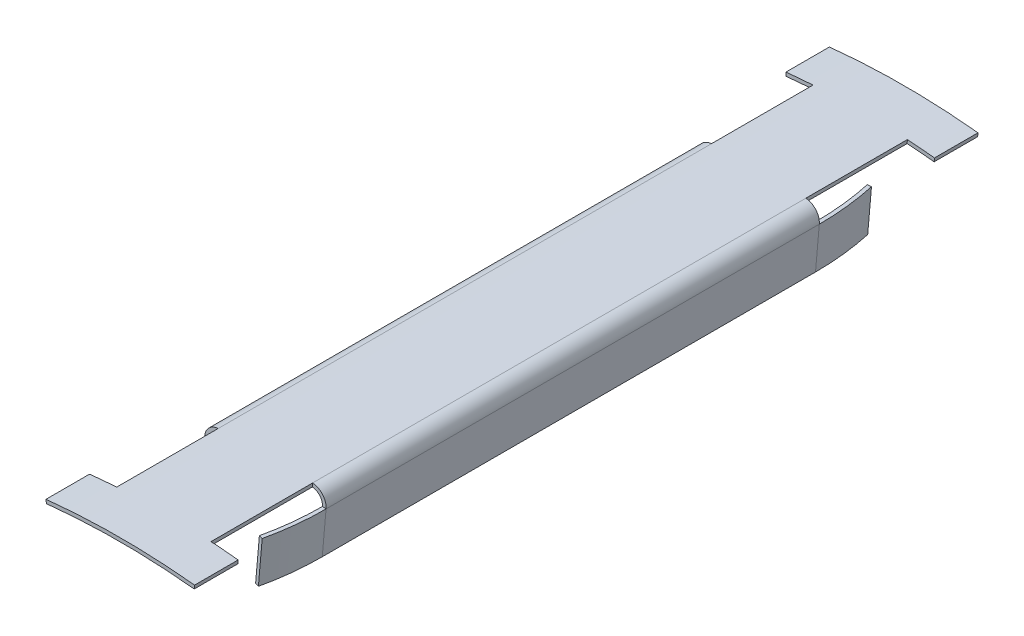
ISO-10303-21;
HEADER;
FILE_DESCRIPTION(('STEP AP214'),'2;1');
FILE_NAME('part.step','',(''),(''),'','','');
FILE_SCHEMA(('AUTOMOTIVE_DESIGN { 1 0 10303 214 1 1 1 1 }'));
ENDSEC;
DATA;
#1=APPLICATION_CONTEXT('core data for automotive mechanical design processes');
#2=APPLICATION_PROTOCOL_DEFINITION('international standard','automotive_design',2000,#1);
#3=PRODUCT_CONTEXT('',#1,'mechanical');
#4=PRODUCT('Part','Part','',(#3));
#5=PRODUCT_RELATED_PRODUCT_CATEGORY('part','',(#4));
#6=PRODUCT_DEFINITION_FORMATION('','',#4);
#7=PRODUCT_DEFINITION_CONTEXT('part definition',#1,'design');
#8=PRODUCT_DEFINITION('design','',#6,#7);
#9=PRODUCT_DEFINITION_SHAPE('','',#8);
#10=(LENGTH_UNIT() NAMED_UNIT(*) SI_UNIT(.MILLI.,.METRE.));
#11=(NAMED_UNIT(*) PLANE_ANGLE_UNIT() SI_UNIT($,.RADIAN.));
#12=(NAMED_UNIT(*) SI_UNIT($,.STERADIAN.) SOLID_ANGLE_UNIT());
#13=UNCERTAINTY_MEASURE_WITH_UNIT(LENGTH_MEASURE(1.E-05),#10,'distance_accuracy_value','');
#14=(GEOMETRIC_REPRESENTATION_CONTEXT(3) GLOBAL_UNCERTAINTY_ASSIGNED_CONTEXT((#13)) GLOBAL_UNIT_ASSIGNED_CONTEXT((#10,
#11,#12)) REPRESENTATION_CONTEXT('',''));
#15=CARTESIAN_POINT('',(0.,0.,0.));
#16=DIRECTION('',(0.,0.,1.));
#17=DIRECTION('',(1.,0.,0.));
#18=AXIS2_PLACEMENT_3D('',#15,#16,#17);
#19=CARTESIAN_POINT('',(3.23616006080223,48.6424687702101,-10.));
#20=DIRECTION('',(0.997794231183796,-0.0663827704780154,0.));
#21=DIRECTION('',(0.0663827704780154,0.997794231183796,0.));
#22=AXIS2_PLACEMENT_3D('',#19,#20,#21);
#23=PLANE('',#22);
#24=DIRECTION('',(0.,0.,1.));
#25=VECTOR('',#24,1.);
#26=CARTESIAN_POINT('',(3.23616006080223,48.6424687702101,-10.));
#27=LINE('',#26,#25);
#28=CARTESIAN_POINT('',(3.23616006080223,48.6424687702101,-7.));
#29=VERTEX_POINT('',#28);
#30=CARTESIAN_POINT('',(3.23616006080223,48.6424687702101,0.));
#31=VERTEX_POINT('',#30);
#32=EDGE_CURVE('E55',#29,#31,#27,.T.);
#33=ORIENTED_EDGE('',*,*,#32,.F.);
#34=DIRECTION('',(0.0663827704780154,0.997794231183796,0.));
#35=VECTOR('',#34,1.);
#36=CARTESIAN_POINT('',(3.23616006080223,48.6424687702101,-7.));
#37=LINE('',#36,#35);
#38=CARTESIAN_POINT('',(3.25275575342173,48.8919173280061,-7.));
#39=VERTEX_POINT('',#38);
#40=EDGE_CURVE('E11',#29,#39,#37,.T.);
#41=ORIENTED_EDGE('',*,*,#40,.T.);
#42=DIRECTION('',(0.,0.,1.));
#43=VECTOR('',#42,1.);
#44=CARTESIAN_POINT('',(3.25275575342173,48.8919173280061,-10.));
#45=LINE('',#44,#43);
#46=CARTESIAN_POINT('',(3.25275575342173,48.8919173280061,0.));
#47=VERTEX_POINT('',#46);
#48=EDGE_CURVE('E324',#39,#47,#45,.T.);
#49=ORIENTED_EDGE('',*,*,#48,.T.);
#50=DIRECTION('',(0.0663827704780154,0.997794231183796,0.));
#51=VECTOR('',#50,1.);
#52=CARTESIAN_POINT('',(3.23616006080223,48.6424687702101,0.));
#53=LINE('',#52,#51);
#54=EDGE_CURVE('E320',#31,#47,#53,.T.);
#55=ORIENTED_EDGE('',*,*,#54,.F.);
#56=EDGE_LOOP('',(#33,#41,#49,#55));
#57=FACE_BOUND('',#56,.T.);
#58=ADVANCED_FACE('F37',(#57),#23,.T.);
#59=CARTESIAN_POINT('',(3.23616006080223,48.6424687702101,44.));
#60=DIRECTION('',(0.997794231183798,-0.0663827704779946,0.));
#61=DIRECTION('',(0.0663827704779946,0.997794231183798,0.));
#62=AXIS2_PLACEMENT_3D('',#59,#60,#61);
#63=PLANE('',#62);
#64=DIRECTION('',(0.,0.,-1.));
#65=VECTOR('',#64,1.);
#66=CARTESIAN_POINT('',(3.25275575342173,48.8919173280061,44.));
#67=LINE('',#66,#65);
#68=CARTESIAN_POINT('',(3.25275575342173,48.8919173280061,41.));
#69=VERTEX_POINT('',#68);
#70=CARTESIAN_POINT('',(3.25275575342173,48.8919173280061,34.));
#71=VERTEX_POINT('',#70);
#72=EDGE_CURVE('E316',#69,#71,#67,.T.);
#73=ORIENTED_EDGE('',*,*,#72,.F.);
#74=DIRECTION('',(-0.0663827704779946,-0.997794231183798,0.));
#75=VECTOR('',#74,1.);
#76=CARTESIAN_POINT('',(3.23616006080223,48.6424687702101,41.));
#77=LINE('',#76,#75);
#78=CARTESIAN_POINT('',(3.23616006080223,48.6424687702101,41.));
#79=VERTEX_POINT('',#78);
#80=EDGE_CURVE('E45',#69,#79,#77,.T.);
#81=ORIENTED_EDGE('',*,*,#80,.T.);
#82=DIRECTION('',(0.,0.,-1.));
#83=VECTOR('',#82,1.);
#84=CARTESIAN_POINT('',(3.23616006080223,48.6424687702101,44.));
#85=LINE('',#84,#83);
#86=CARTESIAN_POINT('',(3.23616006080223,48.6424687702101,34.));
#87=VERTEX_POINT('',#86);
#88=EDGE_CURVE('E318',#79,#87,#85,.T.);
#89=ORIENTED_EDGE('',*,*,#88,.T.);
#90=DIRECTION('',(-0.0663827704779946,-0.997794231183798,0.));
#91=VECTOR('',#90,1.);
#92=CARTESIAN_POINT('',(3.23616006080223,48.6424687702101,34.));
#93=LINE('',#92,#91);
#94=EDGE_CURVE('E311',#71,#87,#93,.T.);
#95=ORIENTED_EDGE('',*,*,#94,.F.);
#96=EDGE_LOOP('',(#73,#81,#89,#95));
#97=FACE_BOUND('',#96,.T.);
#98=ADVANCED_FACE('F510',(#97),#63,.T.);
#99=CARTESIAN_POINT('',(3.18637298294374,47.8941230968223,34.));
#100=DIRECTION('',(0.,0.,1.));
#101=DIRECTION('',(-1.,0.,0.));
#102=AXIS2_PLACEMENT_3D('',#99,#100,#101);
#103=PLANE('',#102);
#104=ORIENTED_EDGE('',*,*,#94,.T.);
#105=CARTESIAN_POINT('',(3.18637298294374,47.8941230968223,34.));
#106=DIRECTION('',(0.,0.,1.));
#107=DIRECTION('',(-1.,0.,0.));
#108=AXIS2_PLACEMENT_3D('',#105,#106,#107);
#109=CIRCLE('',#108,0.750000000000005);
#110=CARTESIAN_POINT('',(3.93351900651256,47.8287562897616,34.));
#111=VERTEX_POINT('',#110);
#112=EDGE_CURVE('E388',#111,#87,#109,.T.);
#113=ORIENTED_EDGE('',*,*,#112,.F.);
#114=DIRECTION('',(0.0871557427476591,0.996194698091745,0.));
#115=VECTOR('',#114,1.);
#116=CARTESIAN_POINT('',(3.93351900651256,47.8287562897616,34.));
#117=LINE('',#116,#115);
#118=CARTESIAN_POINT('',(3.93350009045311,47.8285400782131,34.));
#119=VERTEX_POINT('',#118);
#120=EDGE_CURVE('E391',#119,#111,#117,.T.);
#121=ORIENTED_EDGE('',*,*,#120,.F.);
#122=DIRECTION('',(-0.996194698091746,0.0871557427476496,0.));
#123=VECTOR('',#122,1.);
#124=CARTESIAN_POINT('',(4.18254876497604,47.8067511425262,34.));
#125=LINE('',#124,#123);
#126=CARTESIAN_POINT('',(4.18254876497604,47.8067511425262,34.));
#127=VERTEX_POINT('',#126);
#128=EDGE_CURVE('E364',#127,#119,#125,.T.);
#129=ORIENTED_EDGE('',*,*,#128,.F.);
#130=DIRECTION('',(-0.087155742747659,-0.996194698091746,0.));
#131=VECTOR('',#130,1.);
#132=CARTESIAN_POINT('',(3.92108153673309,44.8181670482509,34.));
#133=LINE('',#132,#131);
#134=CARTESIAN_POINT('',(4.18256768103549,47.8069673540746,34.));
#135=VERTEX_POINT('',#134);
#136=EDGE_CURVE('E395',#135,#127,#133,.T.);
#137=ORIENTED_EDGE('',*,*,#136,.F.);
#138=CARTESIAN_POINT('',(3.18637298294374,47.8941230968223,34.));
#139=DIRECTION('',(0.,0.,-1.));
#140=DIRECTION('',(1.,0.,0.));
#141=AXIS2_PLACEMENT_3D('',#138,#139,#140);
#142=CIRCLE('',#141,1.);
#143=EDGE_CURVE('E398',#71,#135,#142,.T.);
#144=ORIENTED_EDGE('',*,*,#143,.F.);
#145=EDGE_LOOP('',(#104,#113,#121,#129,#137,#144));
#146=FACE_BOUND('',#145,.T.);
#147=ADVANCED_FACE('F706',(#146),#103,.T.);
#148=CARTESIAN_POINT('',(-3.23616006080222,48.6424687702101,-10.));
#149=DIRECTION('',(0.997794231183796,0.0663827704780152,0.));
#150=DIRECTION('',(-0.0663827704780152,0.997794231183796,0.));
#151=AXIS2_PLACEMENT_3D('',#148,#149,#150);
#152=PLANE('',#151);
#153=DIRECTION('',(-0.0663827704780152,0.997794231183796,0.));
#154=VECTOR('',#153,1.);
#155=CARTESIAN_POINT('',(-3.23616006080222,48.6424687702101,-7.));
#156=LINE('',#155,#154);
#157=CARTESIAN_POINT('',(-3.23616006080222,48.6424687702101,-7.));
#158=VERTEX_POINT('',#157);
#159=CARTESIAN_POINT('',(-3.25275575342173,48.8919173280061,-7.));
#160=VERTEX_POINT('',#159);
#161=EDGE_CURVE('E505',#158,#160,#156,.T.);
#162=ORIENTED_EDGE('',*,*,#161,.F.);
#163=DIRECTION('',(0.,0.,1.));
#164=VECTOR('',#163,1.);
#165=CARTESIAN_POINT('',(-3.23616006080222,48.6424687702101,-10.));
#166=LINE('',#165,#164);
#167=CARTESIAN_POINT('',(-3.23616006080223,48.6424687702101,0.));
#168=VERTEX_POINT('',#167);
#169=EDGE_CURVE('E464',#158,#168,#166,.T.);
#170=ORIENTED_EDGE('',*,*,#169,.T.);
#171=DIRECTION('',(-0.0663827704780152,0.997794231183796,0.));
#172=VECTOR('',#171,1.);
#173=CARTESIAN_POINT('',(-3.23616006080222,48.6424687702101,0.));
#174=LINE('',#173,#172);
#175=CARTESIAN_POINT('',(-3.25275575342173,48.8919173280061,0.));
#176=VERTEX_POINT('',#175);
#177=EDGE_CURVE('E277',#168,#176,#174,.T.);
#178=ORIENTED_EDGE('',*,*,#177,.T.);
#179=DIRECTION('',(0.,0.,1.));
#180=VECTOR('',#179,1.);
#181=CARTESIAN_POINT('',(-3.25275575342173,48.8919173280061,-10.));
#182=LINE('',#181,#180);
#183=EDGE_CURVE('E462',#160,#176,#182,.T.);
#184=ORIENTED_EDGE('',*,*,#183,.F.);
#185=EDGE_LOOP('',(#162,#170,#178,#184));
#186=FACE_BOUND('',#185,.T.);
#187=ADVANCED_FACE('F672',(#186),#152,.F.);
#188=CARTESIAN_POINT('',(-3.23616006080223,48.6424687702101,44.));
#189=DIRECTION('',(0.997794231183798,0.0663827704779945,0.));
#190=DIRECTION('',(-0.0663827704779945,0.997794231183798,0.));
#191=AXIS2_PLACEMENT_3D('',#188,#189,#190);
#192=PLANE('',#191);
#193=DIRECTION('',(0.0663827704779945,-0.997794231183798,0.));
#194=VECTOR('',#193,1.);
#195=CARTESIAN_POINT('',(-3.23616006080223,48.6424687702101,41.));
#196=LINE('',#195,#194);
#197=CARTESIAN_POINT('',(-3.25275575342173,48.8919173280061,41.));
#198=VERTEX_POINT('',#197);
#199=CARTESIAN_POINT('',(-3.23616006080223,48.6424687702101,41.));
#200=VERTEX_POINT('',#199);
#201=EDGE_CURVE('E503',#198,#200,#196,.T.);
#202=ORIENTED_EDGE('',*,*,#201,.F.);
#203=DIRECTION('',(0.,0.,-1.));
#204=VECTOR('',#203,1.);
#205=CARTESIAN_POINT('',(-3.25275575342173,48.8919173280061,44.));
#206=LINE('',#205,#204);
#207=CARTESIAN_POINT('',(-3.25275575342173,48.8919173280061,34.));
#208=VERTEX_POINT('',#207);
#209=EDGE_CURVE('E457',#198,#208,#206,.T.);
#210=ORIENTED_EDGE('',*,*,#209,.T.);
#211=DIRECTION('',(0.0663827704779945,-0.997794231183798,0.));
#212=VECTOR('',#211,1.);
#213=CARTESIAN_POINT('',(-3.23616006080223,48.6424687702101,34.));
#214=LINE('',#213,#212);
#215=CARTESIAN_POINT('',(-3.23616006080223,48.6424687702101,34.));
#216=VERTEX_POINT('',#215);
#217=EDGE_CURVE('E446',#208,#216,#214,.T.);
#218=ORIENTED_EDGE('',*,*,#217,.T.);
#219=DIRECTION('',(0.,0.,-1.));
#220=VECTOR('',#219,1.);
#221=CARTESIAN_POINT('',(-3.23616006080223,48.6424687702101,44.));
#222=LINE('',#221,#220);
#223=EDGE_CURVE('E455',#200,#216,#222,.T.);
#224=ORIENTED_EDGE('',*,*,#223,.F.);
#225=EDGE_LOOP('',(#202,#210,#218,#224));
#226=FACE_BOUND('',#225,.T.);
#227=ADVANCED_FACE('F541',(#226),#192,.F.);
#228=CARTESIAN_POINT('',(-3.18637298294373,47.8941230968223,34.));
#229=DIRECTION('',(0.,0.,1.));
#230=DIRECTION('',(1.,0.,0.));
#231=AXIS2_PLACEMENT_3D('',#228,#229,#230);
#232=PLANE('',#231);
#233=CARTESIAN_POINT('',(-3.18637298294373,47.8941230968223,34.));
#234=DIRECTION('',(0.,0.,-1.));
#235=DIRECTION('',(1.,0.,0.));
#236=AXIS2_PLACEMENT_3D('',#233,#234,#235);
#237=CIRCLE('',#236,0.750000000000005);
#238=CARTESIAN_POINT('',(-3.93351900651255,47.8287562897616,34.));
#239=VERTEX_POINT('',#238);
#240=EDGE_CURVE('E550',#239,#216,#237,.T.);
#241=ORIENTED_EDGE('',*,*,#240,.T.);
#242=ORIENTED_EDGE('',*,*,#217,.F.);
#243=CARTESIAN_POINT('',(-3.18637298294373,47.8941230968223,34.));
#244=DIRECTION('',(0.,0.,1.));
#245=DIRECTION('',(-1.,0.,0.));
#246=AXIS2_PLACEMENT_3D('',#243,#244,#245);
#247=CIRCLE('',#246,1.);
#248=CARTESIAN_POINT('',(-4.18256768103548,47.8069673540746,34.));
#249=VERTEX_POINT('',#248);
#250=EDGE_CURVE('E547',#208,#249,#247,.T.);
#251=ORIENTED_EDGE('',*,*,#250,.T.);
#252=DIRECTION('',(0.0871557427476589,-0.996194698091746,0.));
#253=VECTOR('',#252,1.);
#254=CARTESIAN_POINT('',(-3.92108153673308,44.8181670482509,34.));
#255=LINE('',#254,#253);
#256=CARTESIAN_POINT('',(-4.18254876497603,47.8067511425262,34.));
#257=VERTEX_POINT('',#256);
#258=EDGE_CURVE('E571',#249,#257,#255,.T.);
#259=ORIENTED_EDGE('',*,*,#258,.T.);
#260=DIRECTION('',(0.996194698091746,0.0871557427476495,0.));
#261=VECTOR('',#260,1.);
#262=CARTESIAN_POINT('',(-4.18254876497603,47.8067511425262,34.));
#263=LINE('',#262,#261);
#264=CARTESIAN_POINT('',(-3.93350009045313,47.8285400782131,34.));
#265=VERTEX_POINT('',#264);
#266=EDGE_CURVE('E586',#257,#265,#263,.T.);
#267=ORIENTED_EDGE('',*,*,#266,.T.);
#268=DIRECTION('',(-0.0871557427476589,0.996194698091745,0.));
#269=VECTOR('',#268,1.);
#270=CARTESIAN_POINT('',(-3.93351900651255,47.8287562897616,34.));
#271=LINE('',#270,#269);
#272=EDGE_CURVE('E554',#265,#239,#271,.T.);
#273=ORIENTED_EDGE('',*,*,#272,.T.);
#274=EDGE_LOOP('',(#241,#242,#251,#259,#267,#273));
#275=FACE_BOUND('',#274,.T.);
#276=ADVANCED_FACE('F545',(#275),#232,.T.);
#277=CARTESIAN_POINT('',(-3.18637298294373,47.8941230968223,0.));
#278=DIRECTION('',(0.,0.,1.));
#279=DIRECTION('',(1.,0.,0.));
#280=AXIS2_PLACEMENT_3D('',#277,#278,#279);
#281=PLANE('',#280);
#282=ORIENTED_EDGE('',*,*,#177,.F.);
#283=CARTESIAN_POINT('',(-3.18637298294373,47.8941230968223,0.));
#284=DIRECTION('',(0.,0.,-1.));
#285=DIRECTION('',(1.,0.,0.));
#286=AXIS2_PLACEMENT_3D('',#283,#284,#285);
#287=CIRCLE('',#286,0.750000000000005);
#288=CARTESIAN_POINT('',(-3.93351900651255,47.8287562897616,0.));
#289=VERTEX_POINT('',#288);
#290=EDGE_CURVE('E562',#289,#168,#287,.T.);
#291=ORIENTED_EDGE('',*,*,#290,.F.);
#292=DIRECTION('',(-0.0871557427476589,0.996194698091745,0.));
#293=VECTOR('',#292,1.);
#294=CARTESIAN_POINT('',(-3.93351900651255,47.8287562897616,0.));
#295=LINE('',#294,#293);
#296=CARTESIAN_POINT('',(-3.9335000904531,47.8285400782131,0.));
#297=VERTEX_POINT('',#296);
#298=EDGE_CURVE('E612',#297,#289,#295,.T.);
#299=ORIENTED_EDGE('',*,*,#298,.F.);
#300=DIRECTION('',(-0.996194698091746,-0.0871557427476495,0.));
#301=VECTOR('',#300,1.);
#302=CARTESIAN_POINT('',(-4.18254876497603,47.8067511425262,0.));
#303=LINE('',#302,#301);
#304=CARTESIAN_POINT('',(-4.18254876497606,47.8067511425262,0.));
#305=VERTEX_POINT('',#304);
#306=EDGE_CURVE('E481',#297,#305,#303,.T.);
#307=ORIENTED_EDGE('',*,*,#306,.T.);
#308=DIRECTION('',(0.0871557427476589,-0.996194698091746,0.));
#309=VECTOR('',#308,1.);
#310=CARTESIAN_POINT('',(-3.92108153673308,44.8181670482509,0.));
#311=LINE('',#310,#309);
#312=CARTESIAN_POINT('',(-4.18256768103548,47.8069673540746,0.));
#313=VERTEX_POINT('',#312);
#314=EDGE_CURVE('E486',#313,#305,#311,.T.);
#315=ORIENTED_EDGE('',*,*,#314,.F.);
#316=CARTESIAN_POINT('',(-3.18637298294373,47.8941230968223,0.));
#317=DIRECTION('',(0.,0.,1.));
#318=DIRECTION('',(-1.,0.,0.));
#319=AXIS2_PLACEMENT_3D('',#316,#317,#318);
#320=CIRCLE('',#319,1.);
#321=EDGE_CURVE('E606',#176,#313,#320,.T.);
#322=ORIENTED_EDGE('',*,*,#321,.F.);
#323=EDGE_LOOP('',(#282,#291,#299,#307,#315,#322));
#324=FACE_BOUND('',#323,.T.);
#325=ADVANCED_FACE('F630',(#324),#281,.F.);
#326=CARTESIAN_POINT('',(-3.18637298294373,47.8941230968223,34.));
#327=DIRECTION('',(0.,0.,-1.));
#328=DIRECTION('',(-1.,0.,0.));
#329=AXIS2_PLACEMENT_3D('',#326,#327,#328);
#330=CYLINDRICAL_SURFACE('',#329,0.750000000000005);
#331=ORIENTED_EDGE('',*,*,#290,.T.);
#332=DIRECTION('',(0.,0.,-1.));
#333=VECTOR('',#332,1.);
#334=CARTESIAN_POINT('',(-3.23616006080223,48.6424687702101,34.));
#335=LINE('',#334,#333);
#336=EDGE_CURVE('E506',#216,#168,#335,.T.);
#337=ORIENTED_EDGE('',*,*,#336,.F.);
#338=ORIENTED_EDGE('',*,*,#240,.F.);
#339=DIRECTION('',(0.,0.,-1.));
#340=VECTOR('',#339,1.);
#341=CARTESIAN_POINT('',(-3.93351900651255,47.8287562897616,34.));
#342=LINE('',#341,#340);
#343=EDGE_CURVE('E580',#239,#289,#342,.T.);
#344=ORIENTED_EDGE('',*,*,#343,.T.);
#345=EDGE_LOOP('',(#331,#337,#338,#344));
#346=FACE_BOUND('',#345,.T.);
#347=ADVANCED_FACE('F39',(#346),#330,.F.);
#348=CARTESIAN_POINT('',(0.,0.,34.));
#349=DIRECTION('',(0.,0.,-1.));
#350=DIRECTION('',(-1.,0.,0.));
#351=AXIS2_PLACEMENT_3D('',#348,#349,#350);
#352=CYLINDRICAL_SURFACE('',#351,48.75);
#353=DIRECTION('',(0.,0.,-1.));
#354=VECTOR('',#353,1.);
#355=CARTESIAN_POINT('',(-5.09576258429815,48.4829423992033,-7.));
#356=LINE('',#355,#354);
#357=CARTESIAN_POINT('',(-5.09576258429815,48.4829423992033,-7.));
#358=VERTEX_POINT('',#357);
#359=CARTESIAN_POINT('',(-5.09576258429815,48.4829423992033,-10.));
#360=VERTEX_POINT('',#359);
#361=EDGE_CURVE('E426',#358,#360,#356,.T.);
#362=ORIENTED_EDGE('',*,*,#361,.T.);
#363=CARTESIAN_POINT('',(0.,0.,-10.));
#364=DIRECTION('',(0.,0.,1.));
#365=DIRECTION('',(-1.,0.,0.));
#366=AXIS2_PLACEMENT_3D('',#363,#364,#365);
#367=CIRCLE('',#366,48.75);
#368=CARTESIAN_POINT('',(5.09576258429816,48.4829423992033,-10.));
#369=VERTEX_POINT('',#368);
#370=EDGE_CURVE('E276',#369,#360,#367,.T.);
#371=ORIENTED_EDGE('',*,*,#370,.F.);
#372=DIRECTION('',(0.,0.,-1.));
#373=VECTOR('',#372,1.);
#374=CARTESIAN_POINT('',(5.09576258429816,48.4829423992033,-7.));
#375=LINE('',#374,#373);
#376=CARTESIAN_POINT('',(5.09576258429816,48.4829423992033,-7.));
#377=VERTEX_POINT('',#376);
#378=EDGE_CURVE('E286',#377,#369,#375,.T.);
#379=ORIENTED_EDGE('',*,*,#378,.F.);
#380=CARTESIAN_POINT('',(0.,0.,-7.));
#381=DIRECTION('',(0.,0.,-1.));
#382=DIRECTION('',(1.,0.,0.));
#383=AXIS2_PLACEMENT_3D('',#380,#381,#382);
#384=CIRCLE('',#383,48.75);
#385=EDGE_CURVE('E287',#29,#377,#384,.T.);
#386=ORIENTED_EDGE('',*,*,#385,.F.);
#387=ORIENTED_EDGE('',*,*,#32,.T.);
#388=DIRECTION('',(0.,0.,-1.));
#389=VECTOR('',#388,1.);
#390=CARTESIAN_POINT('',(3.23616006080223,48.6424687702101,34.));
#391=LINE('',#390,#389);
#392=EDGE_CURVE('E401',#87,#31,#391,.T.);
#393=ORIENTED_EDGE('',*,*,#392,.F.);
#394=ORIENTED_EDGE('',*,*,#88,.F.);
#395=CARTESIAN_POINT('',(0.,0.,41.));
#396=DIRECTION('',(0.,0.,1.));
#397=DIRECTION('',(-1.,0.,0.));
#398=AXIS2_PLACEMENT_3D('',#395,#396,#397);
#399=CIRCLE('',#398,48.75);
#400=CARTESIAN_POINT('',(5.09576258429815,48.4829423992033,41.));
#401=VERTEX_POINT('',#400);
#402=EDGE_CURVE('E302',#401,#79,#399,.T.);
#403=ORIENTED_EDGE('',*,*,#402,.F.);
#404=DIRECTION('',(0.,0.,1.));
#405=VECTOR('',#404,1.);
#406=CARTESIAN_POINT('',(5.09576258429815,48.4829423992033,41.));
#407=LINE('',#406,#405);
#408=CARTESIAN_POINT('',(5.09576258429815,48.4829423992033,44.));
#409=VERTEX_POINT('',#408);
#410=EDGE_CURVE('E307',#401,#409,#407,.T.);
#411=ORIENTED_EDGE('',*,*,#410,.T.);
#412=CARTESIAN_POINT('',(0.,0.,44.));
#413=DIRECTION('',(0.,0.,-1.));
#414=DIRECTION('',(1.,0.,0.));
#415=AXIS2_PLACEMENT_3D('',#412,#413,#414);
#416=CIRCLE('',#415,48.75);
#417=CARTESIAN_POINT('',(-5.09576258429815,48.4829423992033,44.));
#418=VERTEX_POINT('',#417);
#419=EDGE_CURVE('E451',#418,#409,#416,.T.);
#420=ORIENTED_EDGE('',*,*,#419,.F.);
#421=DIRECTION('',(0.,0.,1.));
#422=VECTOR('',#421,1.);
#423=CARTESIAN_POINT('',(-5.09576258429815,48.4829423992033,41.));
#424=LINE('',#423,#422);
#425=CARTESIAN_POINT('',(-5.09576258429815,48.4829423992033,41.));
#426=VERTEX_POINT('',#425);
#427=EDGE_CURVE('E443',#426,#418,#424,.T.);
#428=ORIENTED_EDGE('',*,*,#427,.F.);
#429=CARTESIAN_POINT('',(0.,0.,41.));
#430=DIRECTION('',(0.,0.,-1.));
#431=DIRECTION('',(1.,0.,0.));
#432=AXIS2_PLACEMENT_3D('',#429,#430,#431);
#433=CIRCLE('',#432,48.75);
#434=EDGE_CURVE('E439',#426,#200,#433,.T.);
#435=ORIENTED_EDGE('',*,*,#434,.T.);
#436=ORIENTED_EDGE('',*,*,#223,.T.);
#437=ORIENTED_EDGE('',*,*,#336,.T.);
#438=ORIENTED_EDGE('',*,*,#169,.F.);
#439=CARTESIAN_POINT('',(0.,0.,-7.));
#440=DIRECTION('',(0.,0.,1.));
#441=DIRECTION('',(-1.,0.,0.));
#442=AXIS2_PLACEMENT_3D('',#439,#440,#441);
#443=CIRCLE('',#442,48.75);
#444=EDGE_CURVE('E418',#158,#358,#443,.T.);
#445=ORIENTED_EDGE('',*,*,#444,.T.);
#446=EDGE_LOOP('',(#362,#371,#379,#386,#387,#393,#394,#403,#411,#420,#428,#435,#436,#437,#438,#445));
#447=FACE_BOUND('',#446,.T.);
#448=ADVANCED_FACE('F517',(#447),#352,.F.);
#449=CARTESIAN_POINT('',(0.,0.,34.));
#450=DIRECTION('',(0.,0.,-1.));
#451=DIRECTION('',(-1.,0.,0.));
#452=AXIS2_PLACEMENT_3D('',#449,#450,#451);
#453=CYLINDRICAL_SURFACE('',#452,49.);
#454=DIRECTION('',(0.,0.,-1.));
#455=VECTOR('',#454,1.);
#456=CARTESIAN_POINT('',(5.12189470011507,48.7315728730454,-7.));
#457=LINE('',#456,#455);
#458=CARTESIAN_POINT('',(5.12189470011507,48.7315728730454,-7.));
#459=VERTEX_POINT('',#458);
#460=CARTESIAN_POINT('',(5.12189470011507,48.7315728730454,-10.));
#461=VERTEX_POINT('',#460);
#462=EDGE_CURVE('E283',#459,#461,#457,.T.);
#463=ORIENTED_EDGE('',*,*,#462,.T.);
#464=CARTESIAN_POINT('',(0.,0.,-10.));
#465=DIRECTION('',(0.,0.,-1.));
#466=DIRECTION('',(-1.,0.,0.));
#467=AXIS2_PLACEMENT_3D('',#464,#465,#466);
#468=CIRCLE('',#467,49.);
#469=CARTESIAN_POINT('',(-5.12189470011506,48.7315728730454,-10.));
#470=VERTEX_POINT('',#469);
#471=EDGE_CURVE('E266',#470,#461,#468,.T.);
#472=ORIENTED_EDGE('',*,*,#471,.F.);
#473=DIRECTION('',(0.,0.,-1.));
#474=VECTOR('',#473,1.);
#475=CARTESIAN_POINT('',(-5.12189470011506,48.7315728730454,-7.));
#476=LINE('',#475,#474);
#477=CARTESIAN_POINT('',(-5.12189470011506,48.7315728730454,-7.));
#478=VERTEX_POINT('',#477);
#479=EDGE_CURVE('E427',#478,#470,#476,.T.);
#480=ORIENTED_EDGE('',*,*,#479,.F.);
#481=CARTESIAN_POINT('',(0.,0.,-7.));
#482=DIRECTION('',(0.,0.,-1.));
#483=DIRECTION('',(-1.,0.,0.));
#484=AXIS2_PLACEMENT_3D('',#481,#482,#483);
#485=CIRCLE('',#484,49.);
#486=EDGE_CURVE('E423',#478,#160,#485,.T.);
#487=ORIENTED_EDGE('',*,*,#486,.T.);
#488=ORIENTED_EDGE('',*,*,#183,.T.);
#489=DIRECTION('',(0.,0.,-1.));
#490=VECTOR('',#489,1.);
#491=CARTESIAN_POINT('',(-3.25275575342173,48.8919173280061,34.));
#492=LINE('',#491,#490);
#493=EDGE_CURVE('E564',#208,#176,#492,.T.);
#494=ORIENTED_EDGE('',*,*,#493,.F.);
#495=ORIENTED_EDGE('',*,*,#209,.F.);
#496=CARTESIAN_POINT('',(0.,0.,41.));
#497=DIRECTION('',(0.,0.,1.));
#498=DIRECTION('',(1.,0.,0.));
#499=AXIS2_PLACEMENT_3D('',#496,#497,#498);
#500=CIRCLE('',#499,49.);
#501=CARTESIAN_POINT('',(-5.12189470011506,48.7315728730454,41.));
#502=VERTEX_POINT('',#501);
#503=EDGE_CURVE('E434',#198,#502,#500,.T.);
#504=ORIENTED_EDGE('',*,*,#503,.T.);
#505=DIRECTION('',(0.,0.,1.));
#506=VECTOR('',#505,1.);
#507=CARTESIAN_POINT('',(-5.12189470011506,48.7315728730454,41.));
#508=LINE('',#507,#506);
#509=CARTESIAN_POINT('',(-5.12189470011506,48.7315728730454,44.));
#510=VERTEX_POINT('',#509);
#511=EDGE_CURVE('E442',#502,#510,#508,.T.);
#512=ORIENTED_EDGE('',*,*,#511,.T.);
#513=CARTESIAN_POINT('',(0.,0.,44.));
#514=DIRECTION('',(0.,0.,1.));
#515=DIRECTION('',(1.,0.,0.));
#516=AXIS2_PLACEMENT_3D('',#513,#514,#515);
#517=CIRCLE('',#516,49.);
#518=CARTESIAN_POINT('',(5.12189470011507,48.7315728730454,44.));
#519=VERTEX_POINT('',#518);
#520=EDGE_CURVE('E453',#519,#510,#517,.T.);
#521=ORIENTED_EDGE('',*,*,#520,.F.);
#522=DIRECTION('',(0.,0.,1.));
#523=VECTOR('',#522,1.);
#524=CARTESIAN_POINT('',(5.12189470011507,48.7315728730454,41.));
#525=LINE('',#524,#523);
#526=CARTESIAN_POINT('',(5.12189470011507,48.7315728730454,41.));
#527=VERTEX_POINT('',#526);
#528=EDGE_CURVE('E308',#527,#519,#525,.T.);
#529=ORIENTED_EDGE('',*,*,#528,.F.);
#530=CARTESIAN_POINT('',(0.,0.,41.));
#531=DIRECTION('',(0.,0.,-1.));
#532=DIRECTION('',(-1.,0.,0.));
#533=AXIS2_PLACEMENT_3D('',#530,#531,#532);
#534=CIRCLE('',#533,49.);
#535=EDGE_CURVE('E300',#69,#527,#534,.T.);
#536=ORIENTED_EDGE('',*,*,#535,.F.);
#537=ORIENTED_EDGE('',*,*,#72,.T.);
#538=DIRECTION('',(0.,0.,-1.));
#539=VECTOR('',#538,1.);
#540=CARTESIAN_POINT('',(3.25275575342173,48.8919173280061,34.));
#541=LINE('',#540,#539);
#542=EDGE_CURVE('E404',#71,#47,#541,.T.);
#543=ORIENTED_EDGE('',*,*,#542,.T.);
#544=ORIENTED_EDGE('',*,*,#48,.F.);
#545=CARTESIAN_POINT('',(0.,0.,-7.));
#546=DIRECTION('',(0.,0.,1.));
#547=DIRECTION('',(1.,0.,0.));
#548=AXIS2_PLACEMENT_3D('',#545,#546,#547);
#549=CIRCLE('',#548,49.);
#550=EDGE_CURVE('E291',#459,#39,#549,.T.);
#551=ORIENTED_EDGE('',*,*,#550,.F.);
#552=EDGE_LOOP('',(#463,#472,#480,#487,#488,#494,#495,#504,#512,#521,#529,#536,#537,#543,#544,#551));
#553=FACE_BOUND('',#552,.T.);
#554=ADVANCED_FACE('F289',(#553),#453,.T.);
#555=CARTESIAN_POINT('',(-3.18637298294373,47.8941230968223,34.));
#556=DIRECTION('',(0.,0.,-1.));
#557=DIRECTION('',(-1.,0.,0.));
#558=AXIS2_PLACEMENT_3D('',#555,#556,#557);
#559=CYLINDRICAL_SURFACE('',#558,1.);
#560=ORIENTED_EDGE('',*,*,#321,.T.);
#561=DIRECTION('',(0.,0.,-1.));
#562=VECTOR('',#561,1.);
#563=CARTESIAN_POINT('',(-4.18256768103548,47.8069673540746,34.));
#564=LINE('',#563,#562);
#565=EDGE_CURVE('E567',#249,#313,#564,.T.);
#566=ORIENTED_EDGE('',*,*,#565,.F.);
#567=ORIENTED_EDGE('',*,*,#250,.F.);
#568=ORIENTED_EDGE('',*,*,#493,.T.);
#569=EDGE_LOOP('',(#560,#566,#567,#568));
#570=FACE_BOUND('',#569,.T.);
#571=ADVANCED_FACE('F682',(#570),#559,.T.);
#572=CARTESIAN_POINT('',(-3.92108153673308,44.8181670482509,34.));
#573=DIRECTION('',(0.996194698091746,0.0871557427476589,0.));
#574=DIRECTION('',(-0.0871557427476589,0.996194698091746,0.));
#575=AXIS2_PLACEMENT_3D('',#572,#573,#574);
#576=PLANE('',#575);
#577=ORIENTED_EDGE('',*,*,#314,.T.);
#578=DIRECTION('',(0.0871557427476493,-0.996194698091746,0.));
#579=VECTOR('',#578,1.);
#580=CARTESIAN_POINT('',(-4.18254876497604,47.8067511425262,0.));
#581=LINE('',#580,#579);
#582=CARTESIAN_POINT('',(-3.92108153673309,44.8181670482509,0.));
#583=VERTEX_POINT('',#582);
#584=EDGE_CURVE('E493',#305,#583,#581,.T.);
#585=ORIENTED_EDGE('',*,*,#584,.T.);
#586=DIRECTION('',(0.,0.,-1.));
#587=VECTOR('',#586,1.);
#588=CARTESIAN_POINT('',(-3.92108153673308,44.8181670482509,34.));
#589=LINE('',#588,#587);
#590=CARTESIAN_POINT('',(-3.92108153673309,44.8181670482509,34.));
#591=VERTEX_POINT('',#590);
#592=EDGE_CURVE('E665',#591,#583,#589,.T.);
#593=ORIENTED_EDGE('',*,*,#592,.F.);
#594=DIRECTION('',(0.0871557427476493,-0.996194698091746,0.));
#595=VECTOR('',#594,1.);
#596=CARTESIAN_POINT('',(-4.18254876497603,47.8067511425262,34.));
#597=LINE('',#596,#595);
#598=EDGE_CURVE('E600',#257,#591,#597,.T.);
#599=ORIENTED_EDGE('',*,*,#598,.F.);
#600=ORIENTED_EDGE('',*,*,#258,.F.);
#601=ORIENTED_EDGE('',*,*,#565,.T.);
#602=EDGE_LOOP('',(#577,#585,#593,#599,#600,#601));
#603=FACE_BOUND('',#602,.T.);
#604=ADVANCED_FACE('F622',(#603),#576,.F.);
#605=CARTESIAN_POINT('',(-3.67203286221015,44.8399559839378,34.));
#606=DIRECTION('',(-0.0871557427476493,0.996194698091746,0.));
#607=DIRECTION('',(-0.996194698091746,-0.0871557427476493,0.));
#608=AXIS2_PLACEMENT_3D('',#605,#606,#607);
#609=PLANE('',#608);
#610=ORIENTED_EDGE('',*,*,#592,.T.);
#611=CARTESIAN_POINT('',(16.0028124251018,46.5612819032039,0.));
#612=DIRECTION('',(0.0871557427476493,-0.996194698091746,0.));
#613=DIRECTION('',(-0.996194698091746,-0.0871557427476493,0.));
#614=AXIS2_PLACEMENT_3D('',#611,#612,#613);
#615=CIRCLE('',#614,20.);
#616=CARTESIAN_POINT('',(-3.5185371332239,44.8533851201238,-4.));
#617=VERTEX_POINT('',#616);
#618=EDGE_CURVE('E469',#583,#617,#615,.T.);
#619=ORIENTED_EDGE('',*,*,#618,.T.);
#620=DIRECTION('',(0.976067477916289,0.0853948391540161,0.199999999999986));
#621=VECTOR('',#620,1.);
#622=CARTESIAN_POINT('',(-3.5185371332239,44.8533851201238,-4.));
#623=LINE('',#622,#621);
#624=CARTESIAN_POINT('',(-3.27452026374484,44.8747338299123,-3.95000000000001));
#625=VERTEX_POINT('',#624);
#626=EDGE_CURVE('E472',#617,#625,#623,.T.);
#627=ORIENTED_EDGE('',*,*,#626,.T.);
#628=CARTESIAN_POINT('',(16.0028124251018,46.5612819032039,0.));
#629=DIRECTION('',(-0.0871557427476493,0.996194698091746,0.));
#630=DIRECTION('',(-0.996194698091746,-0.0871557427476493,0.));
#631=AXIS2_PLACEMENT_3D('',#628,#629,#630);
#632=CIRCLE('',#631,19.75);
#633=CARTESIAN_POINT('',(-3.67203286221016,44.8399559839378,0.));
#634=VERTEX_POINT('',#633);
#635=EDGE_CURVE('E466',#625,#634,#632,.T.);
#636=ORIENTED_EDGE('',*,*,#635,.T.);
#637=DIRECTION('',(0.,0.,-1.));
#638=VECTOR('',#637,1.);
#639=CARTESIAN_POINT('',(-3.67203286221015,44.8399559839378,34.));
#640=LINE('',#639,#638);
#641=CARTESIAN_POINT('',(-3.67203286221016,44.8399559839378,34.));
#642=VERTEX_POINT('',#641);
#643=EDGE_CURVE('E666',#642,#634,#640,.T.);
#644=ORIENTED_EDGE('',*,*,#643,.F.);
#645=CARTESIAN_POINT('',(16.0028124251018,46.5612819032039,34.));
#646=DIRECTION('',(-0.0871557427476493,0.996194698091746,0.));
#647=DIRECTION('',(0.996194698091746,0.0871557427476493,0.));
#648=AXIS2_PLACEMENT_3D('',#645,#646,#647);
#649=CIRCLE('',#648,19.75);
#650=CARTESIAN_POINT('',(-3.27452026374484,44.8747338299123,37.95));
#651=VERTEX_POINT('',#650);
#652=EDGE_CURVE('E644',#642,#651,#649,.T.);
#653=ORIENTED_EDGE('',*,*,#652,.T.);
#654=DIRECTION('',(-0.976067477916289,-0.0853948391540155,0.199999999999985));
#655=VECTOR('',#654,1.);
#656=CARTESIAN_POINT('',(-3.5185371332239,44.8533851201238,38.));
#657=LINE('',#656,#655);
#658=CARTESIAN_POINT('',(-3.5185371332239,44.8533851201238,38.));
#659=VERTEX_POINT('',#658);
#660=EDGE_CURVE('E595',#651,#659,#657,.T.);
#661=ORIENTED_EDGE('',*,*,#660,.T.);
#662=CARTESIAN_POINT('',(16.0028124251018,46.5612819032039,34.));
#663=DIRECTION('',(0.0871557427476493,-0.996194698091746,0.));
#664=DIRECTION('',(0.996194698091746,0.0871557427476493,0.));
#665=AXIS2_PLACEMENT_3D('',#662,#663,#664);
#666=CIRCLE('',#665,20.);
#667=EDGE_CURVE('E642',#659,#591,#666,.T.);
#668=ORIENTED_EDGE('',*,*,#667,.T.);
#669=EDGE_LOOP('',(#610,#619,#627,#636,#644,#653,#661,#668));
#670=FACE_BOUND('',#669,.T.);
#671=ADVANCED_FACE('F664',(#670),#609,.F.);
#672=CARTESIAN_POINT('',(-3.93351900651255,47.8287562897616,34.));
#673=DIRECTION('',(-0.996194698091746,-0.087155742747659,0.));
#674=DIRECTION('',(0.0871557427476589,-0.996194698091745,0.));
#675=AXIS2_PLACEMENT_3D('',#672,#673,#674);
#676=PLANE('',#675);
#677=EDGE_CURVE('E558',#634,#297,#295,.T.);
#678=ORIENTED_EDGE('',*,*,#677,.T.);
#679=ORIENTED_EDGE('',*,*,#298,.T.);
#680=ORIENTED_EDGE('',*,*,#343,.F.);
#681=ORIENTED_EDGE('',*,*,#272,.F.);
#682=EDGE_CURVE('E583',#642,#265,#271,.T.);
#683=ORIENTED_EDGE('',*,*,#682,.F.);
#684=ORIENTED_EDGE('',*,*,#643,.T.);
#685=EDGE_LOOP('',(#678,#679,#680,#681,#683,#684));
#686=FACE_BOUND('',#685,.T.);
#687=ADVANCED_FACE('F684',(#686),#676,.F.);
#688=CARTESIAN_POINT('',(15.7413451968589,49.5498659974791,34.));
#689=DIRECTION('',(0.0871557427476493,-0.996194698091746,0.));
#690=DIRECTION('',(0.996194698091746,0.0871557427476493,0.));
#691=AXIS2_PLACEMENT_3D('',#688,#689,#690);
#692=CYLINDRICAL_SURFACE('',#691,20.);
#693=ORIENTED_EDGE('',*,*,#667,.F.);
#694=DIRECTION('',(0.0871557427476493,-0.996194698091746,0.));
#695=VECTOR('',#694,1.);
#696=CARTESIAN_POINT('',(-3.78000436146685,47.841969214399,38.));
#697=LINE('',#696,#695);
#698=CARTESIAN_POINT('',(-3.78000436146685,47.841969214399,38.));
#699=VERTEX_POINT('',#698);
#700=EDGE_CURVE('E601',#699,#659,#697,.T.);
#701=ORIENTED_EDGE('',*,*,#700,.F.);
#702=CARTESIAN_POINT('',(15.7413451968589,49.5498659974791,34.));
#703=DIRECTION('',(0.0871557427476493,-0.996194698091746,0.));
#704=DIRECTION('',(0.996194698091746,0.0871557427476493,0.));
#705=AXIS2_PLACEMENT_3D('',#702,#703,#704);
#706=CIRCLE('',#705,20.);
#707=EDGE_CURVE('E590',#699,#257,#706,.T.);
#708=ORIENTED_EDGE('',*,*,#707,.T.);
#709=ORIENTED_EDGE('',*,*,#598,.T.);
#710=EDGE_LOOP('',(#693,#701,#708,#709));
#711=FACE_BOUND('',#710,.T.);
#712=ADVANCED_FACE('F663',(#711),#692,.T.);
#713=CARTESIAN_POINT('',(-3.78000436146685,47.841969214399,38.));
#714=DIRECTION('',(0.199238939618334,0.0174311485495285,0.979795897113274));
#715=DIRECTION('',(0.979944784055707,0.,-0.199269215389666));
#716=AXIS2_PLACEMENT_3D('',#713,#714,#715);
#717=PLANE('',#716);
#718=ORIENTED_EDGE('',*,*,#660,.F.);
#719=DIRECTION('',(0.0871557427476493,-0.996194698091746,0.));
#720=VECTOR('',#719,1.);
#721=CARTESIAN_POINT('',(-3.53598749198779,47.8633179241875,37.95));
#722=LINE('',#721,#720);
#723=CARTESIAN_POINT('',(-3.53598749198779,47.8633179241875,37.95));
#724=VERTEX_POINT('',#723);
#725=EDGE_CURVE('E603',#724,#651,#722,.T.);
#726=ORIENTED_EDGE('',*,*,#725,.F.);
#727=DIRECTION('',(-0.976067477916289,-0.0853948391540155,0.199999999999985));
#728=VECTOR('',#727,1.);
#729=CARTESIAN_POINT('',(-3.78000436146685,47.841969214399,38.));
#730=LINE('',#729,#728);
#731=EDGE_CURVE('E597',#724,#699,#730,.T.);
#732=ORIENTED_EDGE('',*,*,#731,.T.);
#733=ORIENTED_EDGE('',*,*,#700,.T.);
#734=EDGE_LOOP('',(#718,#726,#732,#733));
#735=FACE_BOUND('',#734,.T.);
#736=ADVANCED_FACE('F855',(#735),#717,.T.);
#737=CARTESIAN_POINT('',(15.7413451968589,49.5498659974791,34.));
#738=DIRECTION('',(0.0871557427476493,-0.996194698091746,0.));
#739=DIRECTION('',(0.996194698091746,0.0871557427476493,0.));
#740=AXIS2_PLACEMENT_3D('',#737,#738,#739);
#741=CYLINDRICAL_SURFACE('',#740,19.75);
#742=ORIENTED_EDGE('',*,*,#652,.F.);
#743=ORIENTED_EDGE('',*,*,#682,.T.);
#744=CARTESIAN_POINT('',(15.7413451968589,49.5498659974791,34.));
#745=DIRECTION('',(-0.0871557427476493,0.996194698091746,0.));
#746=DIRECTION('',(0.996194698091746,0.0871557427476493,0.));
#747=AXIS2_PLACEMENT_3D('',#744,#745,#746);
#748=CIRCLE('',#747,19.75);
#749=EDGE_CURVE('E589',#265,#724,#748,.T.);
#750=ORIENTED_EDGE('',*,*,#749,.T.);
#751=ORIENTED_EDGE('',*,*,#725,.T.);
#752=EDGE_LOOP('',(#742,#743,#750,#751));
#753=FACE_BOUND('',#752,.T.);
#754=ADVANCED_FACE('F687',(#753),#741,.F.);
#755=CARTESIAN_POINT('',(15.7413451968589,49.5498659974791,34.));
#756=DIRECTION('',(0.0871557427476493,-0.996194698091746,0.));
#757=DIRECTION('',(0.996194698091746,0.0871557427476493,0.));
#758=AXIS2_PLACEMENT_3D('',#755,#756,#757);
#759=PLANE('',#758);
#760=ORIENTED_EDGE('',*,*,#707,.F.);
#761=ORIENTED_EDGE('',*,*,#731,.F.);
#762=ORIENTED_EDGE('',*,*,#749,.F.);
#763=ORIENTED_EDGE('',*,*,#266,.F.);
#764=EDGE_LOOP('',(#760,#761,#762,#763));
#765=FACE_BOUND('',#764,.T.);
#766=ADVANCED_FACE('F869',(#765),#759,.F.);
#767=CARTESIAN_POINT('',(15.7413451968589,49.5498659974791,0.));
#768=DIRECTION('',(0.0871557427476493,-0.996194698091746,0.));
#769=DIRECTION('',(0.996194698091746,0.0871557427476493,0.));
#770=AXIS2_PLACEMENT_3D('',#767,#768,#769);
#771=CYLINDRICAL_SURFACE('',#770,19.75);
#772=ORIENTED_EDGE('',*,*,#635,.F.);
#773=DIRECTION('',(0.0871557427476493,-0.996194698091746,0.));
#774=VECTOR('',#773,1.);
#775=CARTESIAN_POINT('',(-3.53598749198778,47.8633179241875,-3.95000000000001));
#776=LINE('',#775,#774);
#777=CARTESIAN_POINT('',(-3.53598749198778,47.8633179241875,-3.95000000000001));
#778=VERTEX_POINT('',#777);
#779=EDGE_CURVE('E639',#778,#625,#776,.T.);
#780=ORIENTED_EDGE('',*,*,#779,.F.);
#781=CARTESIAN_POINT('',(15.7413451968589,49.5498659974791,0.));
#782=DIRECTION('',(-0.0871557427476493,0.996194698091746,0.));
#783=DIRECTION('',(-0.996194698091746,-0.0871557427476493,0.));
#784=AXIS2_PLACEMENT_3D('',#781,#782,#783);
#785=CIRCLE('',#784,19.75);
#786=EDGE_CURVE('E475',#778,#297,#785,.T.);
#787=ORIENTED_EDGE('',*,*,#786,.T.);
#788=ORIENTED_EDGE('',*,*,#677,.F.);
#789=EDGE_LOOP('',(#772,#780,#787,#788));
#790=FACE_BOUND('',#789,.T.);
#791=ADVANCED_FACE('F638',(#790),#771,.F.);
#792=CARTESIAN_POINT('',(-3.78000436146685,47.841969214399,-4.));
#793=DIRECTION('',(0.199238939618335,0.0174311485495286,-0.979795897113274));
#794=DIRECTION('',(-0.979944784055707,0.,-0.199269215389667));
#795=AXIS2_PLACEMENT_3D('',#792,#793,#794);
#796=PLANE('',#795);
#797=ORIENTED_EDGE('',*,*,#626,.F.);
#798=DIRECTION('',(0.0871557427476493,-0.996194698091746,0.));
#799=VECTOR('',#798,1.);
#800=CARTESIAN_POINT('',(-3.78000436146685,47.841969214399,-4.));
#801=LINE('',#800,#799);
#802=CARTESIAN_POINT('',(-3.78000436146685,47.841969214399,-4.));
#803=VERTEX_POINT('',#802);
#804=EDGE_CURVE('E496',#803,#617,#801,.T.);
#805=ORIENTED_EDGE('',*,*,#804,.F.);
#806=DIRECTION('',(0.976067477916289,0.0853948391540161,0.199999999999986));
#807=VECTOR('',#806,1.);
#808=CARTESIAN_POINT('',(-3.78000436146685,47.841969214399,-4.));
#809=LINE('',#808,#807);
#810=EDGE_CURVE('E478',#803,#778,#809,.T.);
#811=ORIENTED_EDGE('',*,*,#810,.T.);
#812=ORIENTED_EDGE('',*,*,#779,.T.);
#813=EDGE_LOOP('',(#797,#805,#811,#812));
#814=FACE_BOUND('',#813,.T.);
#815=ADVANCED_FACE('F689',(#814),#796,.T.);
#816=CARTESIAN_POINT('',(15.7413451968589,49.5498659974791,0.));
#817=DIRECTION('',(0.0871557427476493,-0.996194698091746,0.));
#818=DIRECTION('',(0.996194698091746,0.0871557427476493,0.));
#819=AXIS2_PLACEMENT_3D('',#816,#817,#818);
#820=CYLINDRICAL_SURFACE('',#819,20.);
#821=ORIENTED_EDGE('',*,*,#618,.F.);
#822=ORIENTED_EDGE('',*,*,#584,.F.);
#823=CARTESIAN_POINT('',(15.7413451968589,49.5498659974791,0.));
#824=DIRECTION('',(0.0871557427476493,-0.996194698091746,0.));
#825=DIRECTION('',(-0.996194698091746,-0.0871557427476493,0.));
#826=AXIS2_PLACEMENT_3D('',#823,#824,#825);
#827=CIRCLE('',#826,20.);
#828=EDGE_CURVE('E485',#305,#803,#827,.T.);
#829=ORIENTED_EDGE('',*,*,#828,.T.);
#830=ORIENTED_EDGE('',*,*,#804,.T.);
#831=EDGE_LOOP('',(#821,#822,#829,#830));
#832=FACE_BOUND('',#831,.T.);
#833=ADVANCED_FACE('F691',(#832),#820,.T.);
#834=CARTESIAN_POINT('',(15.7413451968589,49.5498659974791,0.));
#835=DIRECTION('',(-0.0871557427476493,0.996194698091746,0.));
#836=DIRECTION('',(-0.996194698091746,-0.0871557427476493,0.));
#837=AXIS2_PLACEMENT_3D('',#834,#835,#836);
#838=PLANE('',#837);
#839=ORIENTED_EDGE('',*,*,#786,.F.);
#840=ORIENTED_EDGE('',*,*,#810,.F.);
#841=ORIENTED_EDGE('',*,*,#828,.F.);
#842=ORIENTED_EDGE('',*,*,#306,.F.);
#843=EDGE_LOOP('',(#839,#840,#841,#842));
#844=FACE_BOUND('',#843,.T.);
#845=ADVANCED_FACE('F633',(#844),#838,.T.);
#846=CARTESIAN_POINT('',(0.,0.,-10.));
#847=DIRECTION('',(0.,0.,-1.));
#848=DIRECTION('',(-1.,0.,0.));
#849=AXIS2_PLACEMENT_3D('',#846,#847,#848);
#850=PLANE('',#849);
#851=ORIENTED_EDGE('',*,*,#370,.T.);
#852=DIRECTION('',(-0.104528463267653,0.994521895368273,0.));
#853=VECTOR('',#852,1.);
#854=CARTESIAN_POINT('',(-5.09576258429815,48.4829423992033,-10.));
#855=LINE('',#854,#853);
#856=EDGE_CURVE('E272',#360,#470,#855,.T.);
#857=ORIENTED_EDGE('',*,*,#856,.T.);
#858=ORIENTED_EDGE('',*,*,#471,.T.);
#859=DIRECTION('',(0.104528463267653,0.994521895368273,0.));
#860=VECTOR('',#859,1.);
#861=CARTESIAN_POINT('',(5.09576258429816,48.4829423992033,-10.));
#862=LINE('',#861,#860);
#863=EDGE_CURVE('E269',#369,#461,#862,.T.);
#864=ORIENTED_EDGE('',*,*,#863,.F.);
#865=EDGE_LOOP('',(#851,#857,#858,#864));
#866=FACE_BOUND('',#865,.T.);
#867=ADVANCED_FACE('F268',(#866),#850,.T.);
#868=CARTESIAN_POINT('',(0.,0.,44.));
#869=DIRECTION('',(0.,0.,1.));
#870=DIRECTION('',(1.,0.,0.));
#871=AXIS2_PLACEMENT_3D('',#868,#869,#870);
#872=PLANE('',#871);
#873=ORIENTED_EDGE('',*,*,#520,.T.);
#874=DIRECTION('',(0.104528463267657,-0.994521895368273,0.));
#875=VECTOR('',#874,1.);
#876=CARTESIAN_POINT('',(-5.12189470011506,48.7315728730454,44.));
#877=LINE('',#876,#875);
#878=EDGE_CURVE('E429',#510,#418,#877,.T.);
#879=ORIENTED_EDGE('',*,*,#878,.T.);
#880=ORIENTED_EDGE('',*,*,#419,.T.);
#881=DIRECTION('',(-0.104528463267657,-0.994521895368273,0.));
#882=VECTOR('',#881,1.);
#883=CARTESIAN_POINT('',(5.12189470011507,48.7315728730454,44.));
#884=LINE('',#883,#882);
#885=EDGE_CURVE('E294',#519,#409,#884,.T.);
#886=ORIENTED_EDGE('',*,*,#885,.F.);
#887=EDGE_LOOP('',(#873,#879,#880,#886));
#888=FACE_BOUND('',#887,.T.);
#889=ADVANCED_FACE('F532',(#888),#872,.T.);
#890=CARTESIAN_POINT('',(0.,0.,41.));
#891=DIRECTION('',(0.,0.,1.));
#892=DIRECTION('',(1.,0.,0.));
#893=AXIS2_PLACEMENT_3D('',#890,#891,#892);
#894=PLANE('',#893);
#895=ORIENTED_EDGE('',*,*,#503,.F.);
#896=ORIENTED_EDGE('',*,*,#201,.T.);
#897=ORIENTED_EDGE('',*,*,#434,.F.);
#898=DIRECTION('',(0.104528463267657,-0.994521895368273,0.));
#899=VECTOR('',#898,1.);
#900=CARTESIAN_POINT('',(-5.12189470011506,48.7315728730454,41.));
#901=LINE('',#900,#899);
#902=EDGE_CURVE('E436',#502,#426,#901,.T.);
#903=ORIENTED_EDGE('',*,*,#902,.F.);
#904=EDGE_LOOP('',(#895,#896,#897,#903));
#905=FACE_BOUND('',#904,.T.);
#906=ADVANCED_FACE('F535',(#905),#894,.F.);
#907=CARTESIAN_POINT('',(-5.12189470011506,48.7315728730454,41.));
#908=DIRECTION('',(-0.994521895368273,-0.104528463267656,0.));
#909=DIRECTION('',(0.104528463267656,-0.994521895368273,0.));
#910=AXIS2_PLACEMENT_3D('',#907,#908,#909);
#911=PLANE('',#910);
#912=ORIENTED_EDGE('',*,*,#878,.F.);
#913=ORIENTED_EDGE('',*,*,#511,.F.);
#914=ORIENTED_EDGE('',*,*,#902,.T.);
#915=ORIENTED_EDGE('',*,*,#427,.T.);
#916=EDGE_LOOP('',(#912,#913,#914,#915));
#917=FACE_BOUND('',#916,.T.);
#918=ADVANCED_FACE('F529',(#917),#911,.T.);
#919=CARTESIAN_POINT('',(0.,0.,-7.));
#920=DIRECTION('',(0.,0.,-1.));
#921=DIRECTION('',(-1.,0.,0.));
#922=AXIS2_PLACEMENT_3D('',#919,#920,#921);
#923=PLANE('',#922);
#924=ORIENTED_EDGE('',*,*,#444,.F.);
#925=ORIENTED_EDGE('',*,*,#161,.T.);
#926=ORIENTED_EDGE('',*,*,#486,.F.);
#927=DIRECTION('',(-0.104528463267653,0.994521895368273,0.));
#928=VECTOR('',#927,1.);
#929=CARTESIAN_POINT('',(-5.09576258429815,48.4829423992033,-7.));
#930=LINE('',#929,#928);
#931=EDGE_CURVE('E420',#358,#478,#930,.T.);
#932=ORIENTED_EDGE('',*,*,#931,.F.);
#933=EDGE_LOOP('',(#924,#925,#926,#932));
#934=FACE_BOUND('',#933,.T.);
#935=ADVANCED_FACE('F679',(#934),#923,.F.);
#936=CARTESIAN_POINT('',(-5.09576258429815,48.4829423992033,-7.));
#937=DIRECTION('',(-0.994521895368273,-0.104528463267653,0.));
#938=DIRECTION('',(0.104528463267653,-0.994521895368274,0.));
#939=AXIS2_PLACEMENT_3D('',#936,#937,#938);
#940=PLANE('',#939);
#941=ORIENTED_EDGE('',*,*,#856,.F.);
#942=ORIENTED_EDGE('',*,*,#361,.F.);
#943=ORIENTED_EDGE('',*,*,#931,.T.);
#944=ORIENTED_EDGE('',*,*,#479,.T.);
#945=EDGE_LOOP('',(#941,#942,#943,#944));
#946=FACE_BOUND('',#945,.T.);
#947=ADVANCED_FACE('F677',(#946),#940,.T.);
#948=CARTESIAN_POINT('',(3.18637298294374,47.8941230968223,34.));
#949=DIRECTION('',(0.,0.,-1.));
#950=DIRECTION('',(-1.,0.,0.));
#951=AXIS2_PLACEMENT_3D('',#948,#949,#950);
#952=CYLINDRICAL_SURFACE('',#951,0.750000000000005);
#953=CARTESIAN_POINT('',(3.18637298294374,47.8941230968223,0.));
#954=DIRECTION('',(0.,0.,1.));
#955=DIRECTION('',(-1.,0.,0.));
#956=AXIS2_PLACEMENT_3D('',#953,#954,#955);
#957=CIRCLE('',#956,0.750000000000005);
#958=CARTESIAN_POINT('',(3.93351900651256,47.8287562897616,0.));
#959=VERTEX_POINT('',#958);
#960=EDGE_CURVE('E370',#959,#31,#957,.T.);
#961=ORIENTED_EDGE('',*,*,#960,.F.);
#962=DIRECTION('',(0.,0.,-1.));
#963=VECTOR('',#962,1.);
#964=CARTESIAN_POINT('',(3.93351900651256,47.8287562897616,34.));
#965=LINE('',#964,#963);
#966=EDGE_CURVE('E414',#111,#959,#965,.T.);
#967=ORIENTED_EDGE('',*,*,#966,.F.);
#968=ORIENTED_EDGE('',*,*,#112,.T.);
#969=ORIENTED_EDGE('',*,*,#392,.T.);
#970=EDGE_LOOP('',(#961,#967,#968,#969));
#971=FACE_BOUND('',#970,.T.);
#972=ADVANCED_FACE('F764',(#971),#952,.F.);
#973=CARTESIAN_POINT('',(3.93351900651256,47.8287562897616,34.));
#974=DIRECTION('',(-0.996194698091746,0.0871557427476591,0.));
#975=DIRECTION('',(-0.0871557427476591,-0.996194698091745,0.));
#976=AXIS2_PLACEMENT_3D('',#973,#974,#975);
#977=PLANE('',#976);
#978=DIRECTION('',(0.0871557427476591,0.996194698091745,0.));
#979=VECTOR('',#978,1.);
#980=CARTESIAN_POINT('',(3.93351900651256,47.8287562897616,0.));
#981=LINE('',#980,#979);
#982=CARTESIAN_POINT('',(3.67203286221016,44.8399559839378,0.));
#983=VERTEX_POINT('',#982);
#984=CARTESIAN_POINT('',(3.93350009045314,47.8285400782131,0.));
#985=VERTEX_POINT('',#984);
#986=EDGE_CURVE('E379',#983,#985,#981,.T.);
#987=ORIENTED_EDGE('',*,*,#986,.F.);
#988=DIRECTION('',(0.,0.,-1.));
#989=VECTOR('',#988,1.);
#990=CARTESIAN_POINT('',(3.67203286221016,44.8399559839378,34.));
#991=LINE('',#990,#989);
#992=CARTESIAN_POINT('',(3.67203286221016,44.8399559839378,34.));
#993=VERTEX_POINT('',#992);
#994=EDGE_CURVE('E411',#993,#983,#991,.T.);
#995=ORIENTED_EDGE('',*,*,#994,.F.);
#996=EDGE_CURVE('E392',#993,#119,#117,.T.);
#997=ORIENTED_EDGE('',*,*,#996,.T.);
#998=ORIENTED_EDGE('',*,*,#120,.T.);
#999=ORIENTED_EDGE('',*,*,#966,.T.);
#1000=EDGE_CURVE('E378',#985,#959,#981,.T.);
#1001=ORIENTED_EDGE('',*,*,#1000,.F.);
#1002=EDGE_LOOP('',(#987,#995,#997,#998,#999,#1001));
#1003=FACE_BOUND('',#1002,.T.);
#1004=ADVANCED_FACE('F760',(#1003),#977,.T.);
#1005=CARTESIAN_POINT('',(3.67203286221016,44.8399559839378,34.));
#1006=DIRECTION('',(-0.0871557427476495,-0.996194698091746,0.));
#1007=DIRECTION('',(0.996194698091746,-0.0871557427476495,0.));
#1008=AXIS2_PLACEMENT_3D('',#1005,#1006,#1007);
#1009=PLANE('',#1008);
#1010=ORIENTED_EDGE('',*,*,#994,.T.);
#1011=CARTESIAN_POINT('',(-16.0028124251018,46.5612819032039,0.));
#1012=DIRECTION('',(-0.0871557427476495,-0.996194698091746,0.));
#1013=DIRECTION('',(0.996194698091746,-0.0871557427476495,0.));
#1014=AXIS2_PLACEMENT_3D('',#1011,#1012,#1013);
#1015=CIRCLE('',#1014,19.75);
#1016=CARTESIAN_POINT('',(3.27452026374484,44.8747338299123,-3.95000000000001));
#1017=VERTEX_POINT('',#1016);
#1018=EDGE_CURVE('E326',#1017,#983,#1015,.T.);
#1019=ORIENTED_EDGE('',*,*,#1018,.F.);
#1020=DIRECTION('',(-0.976067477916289,0.0853948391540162,0.199999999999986));
#1021=VECTOR('',#1020,1.);
#1022=CARTESIAN_POINT('',(3.5185371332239,44.8533851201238,-4.));
#1023=LINE('',#1022,#1021);
#1024=CARTESIAN_POINT('',(3.5185371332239,44.8533851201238,-4.));
#1025=VERTEX_POINT('',#1024);
#1026=EDGE_CURVE('E329',#1025,#1017,#1023,.T.);
#1027=ORIENTED_EDGE('',*,*,#1026,.F.);
#1028=CARTESIAN_POINT('',(-16.0028124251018,46.5612819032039,0.));
#1029=DIRECTION('',(0.0871557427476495,0.996194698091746,0.));
#1030=DIRECTION('',(0.996194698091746,-0.0871557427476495,0.));
#1031=AXIS2_PLACEMENT_3D('',#1028,#1029,#1030);
#1032=CIRCLE('',#1031,20.);
#1033=CARTESIAN_POINT('',(3.92108153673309,44.8181670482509,0.));
#1034=VERTEX_POINT('',#1033);
#1035=EDGE_CURVE('E331',#1034,#1025,#1032,.T.);
#1036=ORIENTED_EDGE('',*,*,#1035,.F.);
#1037=DIRECTION('',(0.,0.,-1.));
#1038=VECTOR('',#1037,1.);
#1039=CARTESIAN_POINT('',(3.92108153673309,44.8181670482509,34.));
#1040=LINE('',#1039,#1038);
#1041=CARTESIAN_POINT('',(3.92108153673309,44.8181670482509,34.));
#1042=VERTEX_POINT('',#1041);
#1043=EDGE_CURVE('E409',#1042,#1034,#1040,.T.);
#1044=ORIENTED_EDGE('',*,*,#1043,.F.);
#1045=CARTESIAN_POINT('',(-16.0028124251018,46.5612819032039,34.));
#1046=DIRECTION('',(0.0871557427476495,0.996194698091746,0.));
#1047=DIRECTION('',(-0.996194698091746,0.0871557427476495,0.));
#1048=AXIS2_PLACEMENT_3D('',#1045,#1046,#1047);
#1049=CIRCLE('',#1048,20.);
#1050=CARTESIAN_POINT('',(3.5185371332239,44.8533851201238,38.));
#1051=VERTEX_POINT('',#1050);
#1052=EDGE_CURVE('E347',#1051,#1042,#1049,.T.);
#1053=ORIENTED_EDGE('',*,*,#1052,.F.);
#1054=DIRECTION('',(0.976067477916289,-0.0853948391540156,0.199999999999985));
#1055=VECTOR('',#1054,1.);
#1056=CARTESIAN_POINT('',(3.5185371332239,44.8533851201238,38.));
#1057=LINE('',#1056,#1055);
#1058=CARTESIAN_POINT('',(3.27452026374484,44.8747338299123,37.95));
#1059=VERTEX_POINT('',#1058);
#1060=EDGE_CURVE('E354',#1059,#1051,#1057,.T.);
#1061=ORIENTED_EDGE('',*,*,#1060,.F.);
#1062=CARTESIAN_POINT('',(-16.0028124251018,46.5612819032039,34.));
#1063=DIRECTION('',(-0.0871557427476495,-0.996194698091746,0.));
#1064=DIRECTION('',(-0.996194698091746,0.0871557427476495,0.));
#1065=AXIS2_PLACEMENT_3D('',#1062,#1063,#1064);
#1066=CIRCLE('',#1065,19.75);
#1067=EDGE_CURVE('E356',#993,#1059,#1066,.T.);
#1068=ORIENTED_EDGE('',*,*,#1067,.F.);
#1069=EDGE_LOOP('',(#1010,#1019,#1027,#1036,#1044,#1053,#1061,#1068));
#1070=FACE_BOUND('',#1069,.T.);
#1071=ADVANCED_FACE('F756',(#1070),#1009,.T.);
#1072=CARTESIAN_POINT('',(3.92108153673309,44.8181670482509,34.));
#1073=DIRECTION('',(0.996194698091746,-0.087155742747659,0.));
#1074=DIRECTION('',(0.087155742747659,0.996194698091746,0.));
#1075=AXIS2_PLACEMENT_3D('',#1072,#1073,#1074);
#1076=PLANE('',#1075);
#1077=DIRECTION('',(-0.087155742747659,-0.996194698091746,0.));
#1078=VECTOR('',#1077,1.);
#1079=CARTESIAN_POINT('',(3.92108153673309,44.8181670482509,0.));
#1080=LINE('',#1079,#1078);
#1081=CARTESIAN_POINT('',(4.18256768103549,47.8069673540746,0.));
#1082=VERTEX_POINT('',#1081);
#1083=CARTESIAN_POINT('',(4.18254876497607,47.8067511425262,0.));
#1084=VERTEX_POINT('',#1083);
#1085=EDGE_CURVE('E382',#1082,#1084,#1080,.T.);
#1086=ORIENTED_EDGE('',*,*,#1085,.F.);
#1087=DIRECTION('',(0.,0.,-1.));
#1088=VECTOR('',#1087,1.);
#1089=CARTESIAN_POINT('',(4.18256768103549,47.8069673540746,34.));
#1090=LINE('',#1089,#1088);
#1091=EDGE_CURVE('E407',#135,#1082,#1090,.T.);
#1092=ORIENTED_EDGE('',*,*,#1091,.F.);
#1093=ORIENTED_EDGE('',*,*,#136,.T.);
#1094=DIRECTION('',(-0.0871557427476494,-0.996194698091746,0.));
#1095=VECTOR('',#1094,1.);
#1096=CARTESIAN_POINT('',(4.18254876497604,47.8067511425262,34.));
#1097=LINE('',#1096,#1095);
#1098=EDGE_CURVE('E367',#127,#1042,#1097,.T.);
#1099=ORIENTED_EDGE('',*,*,#1098,.T.);
#1100=ORIENTED_EDGE('',*,*,#1043,.T.);
#1101=DIRECTION('',(-0.0871557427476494,-0.996194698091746,0.));
#1102=VECTOR('',#1101,1.);
#1103=CARTESIAN_POINT('',(4.18254876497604,47.8067511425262,0.));
#1104=LINE('',#1103,#1102);
#1105=EDGE_CURVE('E344',#1084,#1034,#1104,.T.);
#1106=ORIENTED_EDGE('',*,*,#1105,.F.);
#1107=EDGE_LOOP('',(#1086,#1092,#1093,#1099,#1100,#1106));
#1108=FACE_BOUND('',#1107,.T.);
#1109=ADVANCED_FACE('F752',(#1108),#1076,.T.);
#1110=CARTESIAN_POINT('',(3.18637298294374,47.8941230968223,34.));
#1111=DIRECTION('',(0.,0.,-1.));
#1112=DIRECTION('',(-1.,0.,0.));
#1113=AXIS2_PLACEMENT_3D('',#1110,#1111,#1112);
#1114=CYLINDRICAL_SURFACE('',#1113,1.);
#1115=CARTESIAN_POINT('',(3.18637298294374,47.8941230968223,0.));
#1116=DIRECTION('',(0.,0.,-1.));
#1117=DIRECTION('',(1.,0.,0.));
#1118=AXIS2_PLACEMENT_3D('',#1115,#1116,#1117);
#1119=CIRCLE('',#1118,1.);
#1120=EDGE_CURVE('E385',#47,#1082,#1119,.T.);
#1121=ORIENTED_EDGE('',*,*,#1120,.F.);
#1122=ORIENTED_EDGE('',*,*,#542,.F.);
#1123=ORIENTED_EDGE('',*,*,#143,.T.);
#1124=ORIENTED_EDGE('',*,*,#1091,.T.);
#1125=EDGE_LOOP('',(#1121,#1122,#1123,#1124));
#1126=FACE_BOUND('',#1125,.T.);
#1127=ADVANCED_FACE('F745',(#1126),#1114,.T.);
#1128=CARTESIAN_POINT('',(3.18637298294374,47.8941230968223,0.));
#1129=DIRECTION('',(0.,0.,1.));
#1130=DIRECTION('',(-1.,0.,0.));
#1131=AXIS2_PLACEMENT_3D('',#1128,#1129,#1130);
#1132=PLANE('',#1131);
#1133=ORIENTED_EDGE('',*,*,#960,.T.);
#1134=ORIENTED_EDGE('',*,*,#54,.T.);
#1135=ORIENTED_EDGE('',*,*,#1120,.T.);
#1136=ORIENTED_EDGE('',*,*,#1085,.T.);
#1137=DIRECTION('',(0.996194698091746,-0.0871557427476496,0.));
#1138=VECTOR('',#1137,1.);
#1139=CARTESIAN_POINT('',(4.18254876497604,47.8067511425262,0.));
#1140=LINE('',#1139,#1138);
#1141=EDGE_CURVE('E340',#985,#1084,#1140,.T.);
#1142=ORIENTED_EDGE('',*,*,#1141,.F.);
#1143=ORIENTED_EDGE('',*,*,#1000,.T.);
#1144=EDGE_LOOP('',(#1133,#1134,#1135,#1136,#1142,#1143));
#1145=FACE_BOUND('',#1144,.T.);
#1146=ADVANCED_FACE('F741',(#1145),#1132,.F.);
#1147=CARTESIAN_POINT('',(-15.7413451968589,49.5498659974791,34.));
#1148=DIRECTION('',(-0.0871557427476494,-0.996194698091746,0.));
#1149=DIRECTION('',(0.996194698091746,-0.0871557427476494,0.));
#1150=AXIS2_PLACEMENT_3D('',#1147,#1148,#1149);
#1151=CYLINDRICAL_SURFACE('',#1150,20.);
#1152=ORIENTED_EDGE('',*,*,#1052,.T.);
#1153=ORIENTED_EDGE('',*,*,#1098,.F.);
#1154=CARTESIAN_POINT('',(-15.7413451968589,49.5498659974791,34.));
#1155=DIRECTION('',(0.0871557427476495,0.996194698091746,0.));
#1156=DIRECTION('',(-0.996194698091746,0.0871557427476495,0.));
#1157=AXIS2_PLACEMENT_3D('',#1154,#1155,#1156);
#1158=CIRCLE('',#1157,20.);
#1159=CARTESIAN_POINT('',(3.78000436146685,47.841969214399,38.));
#1160=VERTEX_POINT('',#1159);
#1161=EDGE_CURVE('E358',#1160,#127,#1158,.T.);
#1162=ORIENTED_EDGE('',*,*,#1161,.F.);
#1163=DIRECTION('',(-0.0871557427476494,-0.996194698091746,0.));
#1164=VECTOR('',#1163,1.);
#1165=CARTESIAN_POINT('',(3.78000436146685,47.841969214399,38.));
#1166=LINE('',#1165,#1164);
#1167=EDGE_CURVE('E366',#1160,#1051,#1166,.T.);
#1168=ORIENTED_EDGE('',*,*,#1167,.T.);
#1169=EDGE_LOOP('',(#1152,#1153,#1162,#1168));
#1170=FACE_BOUND('',#1169,.T.);
#1171=ADVANCED_FACE('F734',(#1170),#1151,.T.);
#1172=CARTESIAN_POINT('',(-15.7413451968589,49.5498659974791,34.));
#1173=DIRECTION('',(-0.0871557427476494,-0.996194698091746,0.));
#1174=DIRECTION('',(0.996194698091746,-0.0871557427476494,0.));
#1175=AXIS2_PLACEMENT_3D('',#1172,#1173,#1174);
#1176=CYLINDRICAL_SURFACE('',#1175,19.75);
#1177=ORIENTED_EDGE('',*,*,#1067,.T.);
#1178=DIRECTION('',(-0.0871557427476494,-0.996194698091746,0.));
#1179=VECTOR('',#1178,1.);
#1180=CARTESIAN_POINT('',(3.53598749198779,47.8633179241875,37.95));
#1181=LINE('',#1180,#1179);
#1182=CARTESIAN_POINT('',(3.53598749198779,47.8633179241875,37.95));
#1183=VERTEX_POINT('',#1182);
#1184=EDGE_CURVE('E371',#1183,#1059,#1181,.T.);
#1185=ORIENTED_EDGE('',*,*,#1184,.F.);
#1186=CARTESIAN_POINT('',(-15.7413451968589,49.5498659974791,34.));
#1187=DIRECTION('',(-0.0871557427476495,-0.996194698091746,0.));
#1188=DIRECTION('',(-0.996194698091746,0.0871557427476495,0.));
#1189=AXIS2_PLACEMENT_3D('',#1186,#1187,#1188);
#1190=CIRCLE('',#1189,19.75);
#1191=EDGE_CURVE('E362',#119,#1183,#1190,.T.);
#1192=ORIENTED_EDGE('',*,*,#1191,.F.);
#1193=ORIENTED_EDGE('',*,*,#996,.F.);
#1194=EDGE_LOOP('',(#1177,#1185,#1192,#1193));
#1195=FACE_BOUND('',#1194,.T.);
#1196=ADVANCED_FACE('F731',(#1195),#1176,.F.);
#1197=CARTESIAN_POINT('',(3.78000436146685,47.841969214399,38.));
#1198=DIRECTION('',(0.199238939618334,-0.0174311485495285,-0.979795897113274));
#1199=DIRECTION('',(-0.979944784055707,0.,-0.199269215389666));
#1200=AXIS2_PLACEMENT_3D('',#1197,#1198,#1199);
#1201=PLANE('',#1200);
#1202=ORIENTED_EDGE('',*,*,#1060,.T.);
#1203=ORIENTED_EDGE('',*,*,#1167,.F.);
#1204=DIRECTION('',(0.976067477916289,-0.0853948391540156,0.199999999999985));
#1205=VECTOR('',#1204,1.);
#1206=CARTESIAN_POINT('',(3.78000436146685,47.841969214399,38.));
#1207=LINE('',#1206,#1205);
#1208=EDGE_CURVE('E360',#1183,#1160,#1207,.T.);
#1209=ORIENTED_EDGE('',*,*,#1208,.F.);
#1210=ORIENTED_EDGE('',*,*,#1184,.T.);
#1211=EDGE_LOOP('',(#1202,#1203,#1209,#1210));
#1212=FACE_BOUND('',#1211,.T.);
#1213=ADVANCED_FACE('F729',(#1212),#1201,.F.);
#1214=CARTESIAN_POINT('',(-15.7413451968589,49.5498659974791,34.));
#1215=DIRECTION('',(-0.0871557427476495,-0.996194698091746,0.));
#1216=DIRECTION('',(-0.996194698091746,0.0871557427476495,0.));
#1217=AXIS2_PLACEMENT_3D('',#1214,#1215,#1216);
#1218=PLANE('',#1217);
#1219=ORIENTED_EDGE('',*,*,#1161,.T.);
#1220=ORIENTED_EDGE('',*,*,#128,.T.);
#1221=ORIENTED_EDGE('',*,*,#1191,.T.);
#1222=ORIENTED_EDGE('',*,*,#1208,.T.);
#1223=EDGE_LOOP('',(#1219,#1220,#1221,#1222));
#1224=FACE_BOUND('',#1223,.T.);
#1225=ADVANCED_FACE('F725',(#1224),#1218,.F.);
#1226=CARTESIAN_POINT('',(-15.7413451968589,49.5498659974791,0.));
#1227=DIRECTION('',(-0.0871557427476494,-0.996194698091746,0.));
#1228=DIRECTION('',(0.996194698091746,-0.0871557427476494,0.));
#1229=AXIS2_PLACEMENT_3D('',#1226,#1227,#1228);
#1230=CYLINDRICAL_SURFACE('',#1229,19.75);
#1231=ORIENTED_EDGE('',*,*,#1018,.T.);
#1232=ORIENTED_EDGE('',*,*,#986,.T.);
#1233=CARTESIAN_POINT('',(-15.7413451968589,49.5498659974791,0.));
#1234=DIRECTION('',(-0.0871557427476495,-0.996194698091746,0.));
#1235=DIRECTION('',(0.996194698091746,-0.0871557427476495,0.));
#1236=AXIS2_PLACEMENT_3D('',#1233,#1234,#1235);
#1237=CIRCLE('',#1236,19.75);
#1238=CARTESIAN_POINT('',(3.53598749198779,47.8633179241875,-3.95000000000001));
#1239=VERTEX_POINT('',#1238);
#1240=EDGE_CURVE('E333',#1239,#985,#1237,.T.);
#1241=ORIENTED_EDGE('',*,*,#1240,.F.);
#1242=DIRECTION('',(-0.0871557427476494,-0.996194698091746,0.));
#1243=VECTOR('',#1242,1.);
#1244=CARTESIAN_POINT('',(3.53598749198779,47.8633179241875,-3.95000000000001));
#1245=LINE('',#1244,#1243);
#1246=EDGE_CURVE('E343',#1239,#1017,#1245,.T.);
#1247=ORIENTED_EDGE('',*,*,#1246,.T.);
#1248=EDGE_LOOP('',(#1231,#1232,#1241,#1247));
#1249=FACE_BOUND('',#1248,.T.);
#1250=ADVANCED_FACE('F718',(#1249),#1230,.F.);
#1251=CARTESIAN_POINT('',(-15.7413451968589,49.5498659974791,0.));
#1252=DIRECTION('',(-0.0871557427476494,-0.996194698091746,0.));
#1253=DIRECTION('',(0.996194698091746,-0.0871557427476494,0.));
#1254=AXIS2_PLACEMENT_3D('',#1251,#1252,#1253);
#1255=CYLINDRICAL_SURFACE('',#1254,20.);
#1256=ORIENTED_EDGE('',*,*,#1035,.T.);
#1257=DIRECTION('',(-0.0871557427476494,-0.996194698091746,0.));
#1258=VECTOR('',#1257,1.);
#1259=CARTESIAN_POINT('',(3.78000436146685,47.841969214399,-4.));
#1260=LINE('',#1259,#1258);
#1261=CARTESIAN_POINT('',(3.78000436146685,47.841969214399,-4.));
#1262=VERTEX_POINT('',#1261);
#1263=EDGE_CURVE('E348',#1262,#1025,#1260,.T.);
#1264=ORIENTED_EDGE('',*,*,#1263,.F.);
#1265=CARTESIAN_POINT('',(-15.7413451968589,49.5498659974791,0.));
#1266=DIRECTION('',(0.0871557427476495,0.996194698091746,0.));
#1267=DIRECTION('',(0.996194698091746,-0.0871557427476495,0.));
#1268=AXIS2_PLACEMENT_3D('',#1265,#1266,#1267);
#1269=CIRCLE('',#1268,20.);
#1270=EDGE_CURVE('E338',#1084,#1262,#1269,.T.);
#1271=ORIENTED_EDGE('',*,*,#1270,.F.);
#1272=ORIENTED_EDGE('',*,*,#1105,.T.);
#1273=EDGE_LOOP('',(#1256,#1264,#1271,#1272));
#1274=FACE_BOUND('',#1273,.T.);
#1275=ADVANCED_FACE('F715',(#1274),#1255,.T.);
#1276=CARTESIAN_POINT('',(3.78000436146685,47.841969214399,-4.));
#1277=DIRECTION('',(0.199238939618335,-0.0174311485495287,0.979795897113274));
#1278=DIRECTION('',(0.979944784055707,0.,-0.199269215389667));
#1279=AXIS2_PLACEMENT_3D('',#1276,#1277,#1278);
#1280=PLANE('',#1279);
#1281=ORIENTED_EDGE('',*,*,#1026,.T.);
#1282=ORIENTED_EDGE('',*,*,#1246,.F.);
#1283=DIRECTION('',(-0.976067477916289,0.0853948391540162,0.199999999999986));
#1284=VECTOR('',#1283,1.);
#1285=CARTESIAN_POINT('',(3.78000436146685,47.841969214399,-4.));
#1286=LINE('',#1285,#1284);
#1287=EDGE_CURVE('E336',#1262,#1239,#1286,.T.);
#1288=ORIENTED_EDGE('',*,*,#1287,.F.);
#1289=ORIENTED_EDGE('',*,*,#1263,.T.);
#1290=EDGE_LOOP('',(#1281,#1282,#1288,#1289));
#1291=FACE_BOUND('',#1290,.T.);
#1292=ADVANCED_FACE('F713',(#1291),#1280,.F.);
#1293=CARTESIAN_POINT('',(-15.7413451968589,49.5498659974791,0.));
#1294=DIRECTION('',(0.0871557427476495,0.996194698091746,0.));
#1295=DIRECTION('',(0.996194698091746,-0.0871557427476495,0.));
#1296=AXIS2_PLACEMENT_3D('',#1293,#1294,#1295);
#1297=PLANE('',#1296);
#1298=ORIENTED_EDGE('',*,*,#1240,.T.);
#1299=ORIENTED_EDGE('',*,*,#1141,.T.);
#1300=ORIENTED_EDGE('',*,*,#1270,.T.);
#1301=ORIENTED_EDGE('',*,*,#1287,.T.);
#1302=EDGE_LOOP('',(#1298,#1299,#1300,#1301));
#1303=FACE_BOUND('',#1302,.T.);
#1304=ADVANCED_FACE('F710',(#1303),#1297,.T.);
#1305=CARTESIAN_POINT('',(5.12189470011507,48.7315728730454,41.));
#1306=DIRECTION('',(-0.994521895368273,0.104528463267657,0.));
#1307=DIRECTION('',(-0.104528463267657,-0.994521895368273,0.));
#1308=AXIS2_PLACEMENT_3D('',#1305,#1306,#1307);
#1309=PLANE('',#1308);
#1310=ORIENTED_EDGE('',*,*,#885,.T.);
#1311=ORIENTED_EDGE('',*,*,#410,.F.);
#1312=DIRECTION('',(-0.104528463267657,-0.994521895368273,0.));
#1313=VECTOR('',#1312,1.);
#1314=CARTESIAN_POINT('',(5.12189470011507,48.7315728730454,41.));
#1315=LINE('',#1314,#1313);
#1316=EDGE_CURVE('E305',#527,#401,#1315,.T.);
#1317=ORIENTED_EDGE('',*,*,#1316,.F.);
#1318=ORIENTED_EDGE('',*,*,#528,.T.);
#1319=EDGE_LOOP('',(#1310,#1311,#1317,#1318));
#1320=FACE_BOUND('',#1319,.T.);
#1321=ADVANCED_FACE('F523',(#1320),#1309,.F.);
#1322=CARTESIAN_POINT('',(0.,0.,41.));
#1323=DIRECTION('',(0.,0.,1.));
#1324=DIRECTION('',(-1.,0.,0.));
#1325=AXIS2_PLACEMENT_3D('',#1322,#1323,#1324);
#1326=PLANE('',#1325);
#1327=ORIENTED_EDGE('',*,*,#80,.F.);
#1328=ORIENTED_EDGE('',*,*,#535,.T.);
#1329=ORIENTED_EDGE('',*,*,#1316,.T.);
#1330=ORIENTED_EDGE('',*,*,#402,.T.);
#1331=EDGE_LOOP('',(#1327,#1328,#1329,#1330));
#1332=FACE_BOUND('',#1331,.T.);
#1333=ADVANCED_FACE('F518',(#1332),#1326,.F.);
#1334=CARTESIAN_POINT('',(5.09576258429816,48.4829423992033,-7.));
#1335=DIRECTION('',(-0.994521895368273,0.104528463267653,0.));
#1336=DIRECTION('',(-0.104528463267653,-0.994521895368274,0.));
#1337=AXIS2_PLACEMENT_3D('',#1334,#1335,#1336);
#1338=PLANE('',#1337);
#1339=ORIENTED_EDGE('',*,*,#863,.T.);
#1340=ORIENTED_EDGE('',*,*,#462,.F.);
#1341=DIRECTION('',(0.104528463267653,0.994521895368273,0.));
#1342=VECTOR('',#1341,1.);
#1343=CARTESIAN_POINT('',(5.09576258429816,48.4829423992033,-7.));
#1344=LINE('',#1343,#1342);
#1345=EDGE_CURVE('E292',#377,#459,#1344,.T.);
#1346=ORIENTED_EDGE('',*,*,#1345,.F.);
#1347=ORIENTED_EDGE('',*,*,#378,.T.);
#1348=EDGE_LOOP('',(#1339,#1340,#1346,#1347));
#1349=FACE_BOUND('',#1348,.T.);
#1350=ADVANCED_FACE('F281',(#1349),#1338,.F.);
#1351=CARTESIAN_POINT('',(0.,0.,-7.));
#1352=DIRECTION('',(0.,0.,-1.));
#1353=DIRECTION('',(1.,0.,0.));
#1354=AXIS2_PLACEMENT_3D('',#1351,#1352,#1353);
#1355=PLANE('',#1354);
#1356=ORIENTED_EDGE('',*,*,#40,.F.);
#1357=ORIENTED_EDGE('',*,*,#385,.T.);
#1358=ORIENTED_EDGE('',*,*,#1345,.T.);
#1359=ORIENTED_EDGE('',*,*,#550,.T.);
#1360=EDGE_LOOP('',(#1356,#1357,#1358,#1359));
#1361=FACE_BOUND('',#1360,.T.);
#1362=ADVANCED_FACE('F989',(#1361),#1355,.F.);
#1363=CLOSED_SHELL('',(#58,#98,#147,#187,#227,#276,#325,#347,#448,#554,#571,#604,#671,#687,#712,
#736,#754,#766,#791,#815,#833,#845,#867,#889,#906,#918,#935,#947,#972,#1004,#1071,#1109,#1127,
#1146,#1171,#1196,#1213,#1225,#1250,#1275,#1292,#1304,#1321,#1333,#1350,#1362));
#1364=MANIFOLD_SOLID_BREP('B2',#1363);
#1365=ADVANCED_BREP_SHAPE_REPRESENTATION('',(#18,#1364),#14);
#1366=SHAPE_DEFINITION_REPRESENTATION(#9,#1365);
ENDSEC;
END-ISO-10303-21;
